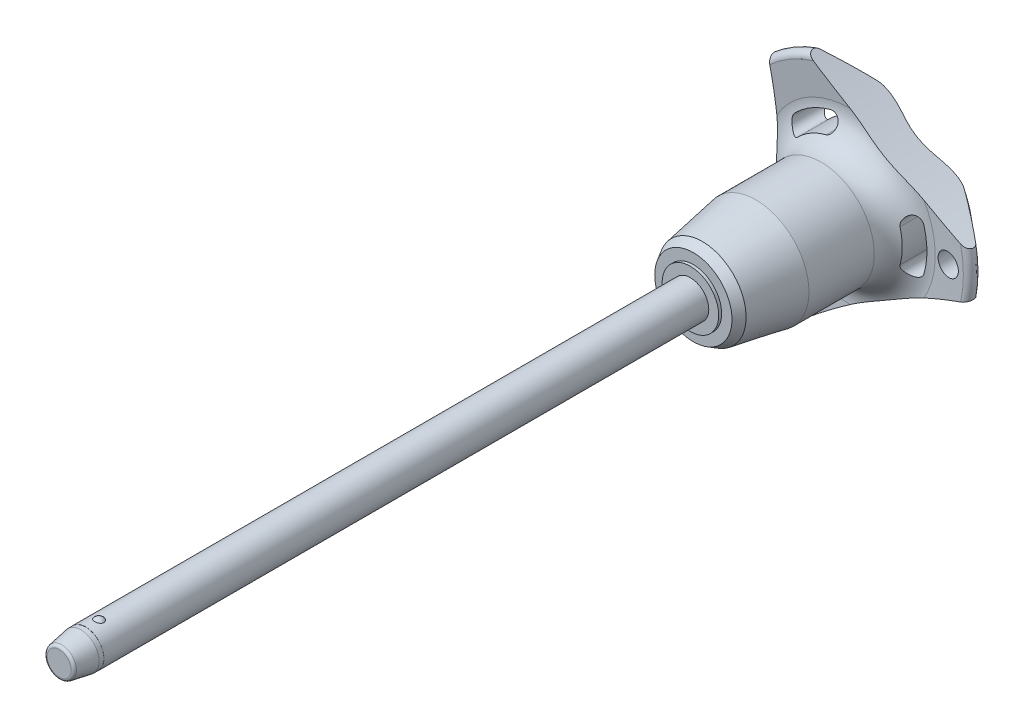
from build123d import *

# Parameters (mm, degrees)
SKETCH1_R           = 2.5
BOSS_EXTRUDE1_DEPTH = 80
SKETCH2_R           = 2.1
BOSS_EXTRUDE2_DEPTH = 26.7
BOSS_EXTRUDE3_START = 6
SKETCH1_2_R         = 2.5
BOSS_EXTRUDE3_DEPTH = 6
CHAMFER1_SIZE       = 3
CHAMFER1_SIZE2      = 0.528980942
FILLET1_R           = 0.4
SKETCH6_R           = 79.96
CUT_EXTRUDE1_DEPTH  = 110.252773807
CIRPATTERN1_COUNT   = 3
SKETCH7_R           = 1.5
CUT_EXTRUDE2_DEPTH  = 110.113366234
SKETCH8_R           = 2.5
SKETCH8_R_2         = 2.49
CUT_EXTRUDE3_DEPTH  = 3.6


with BuildPart() as part:
    # Sketch1 → Boss-Extrude1 (new body)
    with BuildSketch(Plane.XY):
        Circle(SKETCH1_R)
    extrude(amount=-BOSS_EXTRUDE1_DEPTH)

    # Sketch2 → Boss-Extrude2 (add)
    with BuildSketch(Plane(origin=(0, 0, -80), x_dir=(-1, 0, 0), z_dir=(0, 0, -1))):
        Circle(SKETCH2_R)
    extrude(amount=BOSS_EXTRUDE2_DEPTH)

    # Sketch3 → Revolve1 (revolve)
    with BuildSketch(Plane(origin=(0, 0, 0), x_dir=(0, 0, -1), z_dir=(1, 0, 0))):
        with BuildLine():
            Line((-0.580947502, 2.75), (-0.580947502, 1.15))
            ThreePointArc((-0.580947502, 1.15), (0.219052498, 1.95), (-0.580947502, 2.75))
        make_face()
        with BuildLine():
            Line((-0.580947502, -1.15), (-0.580947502, -2.75))
            ThreePointArc((-0.580947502, -2.75), (0.219052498, -1.95), (-0.580947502, -1.15))
        make_face()
    revolve(axis=Axis((0, -1.15, 0.580947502), (0, 1, 0)))

    # Sketch1_2 → Boss-Extrude3 (add)
    with BuildSketch(Plane.XY.offset(BOSS_EXTRUDE3_START)):
        Circle(SKETCH1_2_R)
    extrude(amount=-BOSS_EXTRUDE3_DEPTH)

    # Chamfer1
    chamfer1_edges = [part.edges().sort_by_distance(p)[0] for p in [
        (-2.5, 0, 6),
    ]]
    chamfer1_side = [part.faces().sort_by_distance(p)[0] for p in [
        (-2.5, 0, -37),
    ]]
    chamfer(chamfer1_edges, length=CHAMFER1_SIZE, length2=CHAMFER1_SIZE2, reference=chamfer1_side[0])

    # Fillet1
    fillet1_edges = [part.edges().sort_by_distance(p)[0] for p in [
        (-1.971019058, 0, 6),
        (2.1, 0, -106.7),
    ]]
    fillet(fillet1_edges, radius=FILLET1_R)

    # Sketch4 → Revolve2 (revolve)
    with BuildSketch(Plane(origin=(0, 0, 0), x_dir=(0, 0, -1), z_dir=(1, 0, 0)), mode=Mode.PRIVATE) as revolve2_sk:
        Polygon((80, 0), (80, 3.851837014), (80.4, 3.851837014), (80.4, 5.26161122), (81.620900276, 5.966498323), (88.9, 7.25), (97.8, 7.25), (97.8, 0), align=None)
    revolve(revolve2_sk.sketch.rotate(Axis((0, 0, -97.8), (0, 0, 1)), 90), axis=Axis((0, 0, -97.8), (0, 0, 1)))

    # Sketch5 → Revolve3 (revolve)
    with BuildSketch(Plane(origin=(0, 0, 0), x_dir=(0, 0, -1), z_dir=(1, 0, 0)), mode=Mode.PRIVATE) as revolve3_sk:
        with BuildLine():
            Line((101.78715932, 11.570250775), (101.452568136, 15.735949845))
            ThreePointArc((101.452568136, 15.735949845), (101.946485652, 16.540188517), (102.862835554, 16.314230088))
            Line((102.862835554, 16.314230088), (106.326414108, 12.186497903))
            ThreePointArc((106.326414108, 12.186497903), (106.7, 11.109282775), (106.261488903, 10.056825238))
            ThreePointArc((106.261488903, 10.056825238), (103.289873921, 5.413681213), (102.25, 0))
            Line((102.25, 0), (97.8, 0))
            Line((97.8, 0), (97.8, 7.25))
            ThreePointArc((97.8, 7.25), (100.739473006, 8.537160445), (101.78715932, 11.570250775))
        make_face()
    revolve(revolve3_sk.sketch.rotate(Axis((0, 0, -102.25), (0, 0, 1)), 90), axis=Axis((0, 0, -102.25), (0, 0, 1)))

    # Sketch6 → Cut-Extrude1 (cut, through all)
    with BuildSketch(Plane.XY):
        with Locations((-89.76, 0)):
            Circle(SKETCH6_R)
        with BuildLine():
            ThreePointArc((10.099921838, -2.834717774), (10.490188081, 0), (10.099921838, 2.834717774))
            ThreePointArc((10.099921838, 2.834717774), (8.768180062, 3.582738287), (8.020159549, 2.250996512))
            ThreePointArc((8.020159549, 2.250996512), (8.330062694, 0), (8.020159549, -2.250996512))
            ThreePointArc((8.020159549, -2.250996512), (8.768180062, -3.582738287), (10.099921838, -2.834717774))
        make_face()
    cut_extrude1 = extrude(amount=-CUT_EXTRUDE1_DEPTH, mode=Mode.SUBTRACT)

    # CirPattern1: Cut-Extrude1 ×3 about axis
    cirpattern1_axis = Axis((0, 0, 0), (0, 0, 1))
    for i in range(1, CIRPATTERN1_COUNT):
        add(cut_extrude1.rotate(cirpattern1_axis, i * 360 / CIRPATTERN1_COUNT), mode=Mode.SUBTRACT)

    # Sketch7 → Cut-Extrude2 (cut, through all)
    with BuildSketch(Plane.XY):
        with Locations(Location((13.490188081, 0, 0), (0, 0, 225.221865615))):
            Circle(SKETCH7_R)
    extrude(amount=-CUT_EXTRUDE2_DEPTH, mode=Mode.SUBTRACT)

    # Sketch8 → Cut-Extrude3 (cut)
    with BuildSketch(Plane.XY.offset(6)):
        Circle(SKETCH8_R)
        Circle(SKETCH8_R_2, mode=Mode.SUBTRACT)
    extrude(amount=-CUT_EXTRUDE3_DEPTH, mode=Mode.SUBTRACT)


solid = part.part
